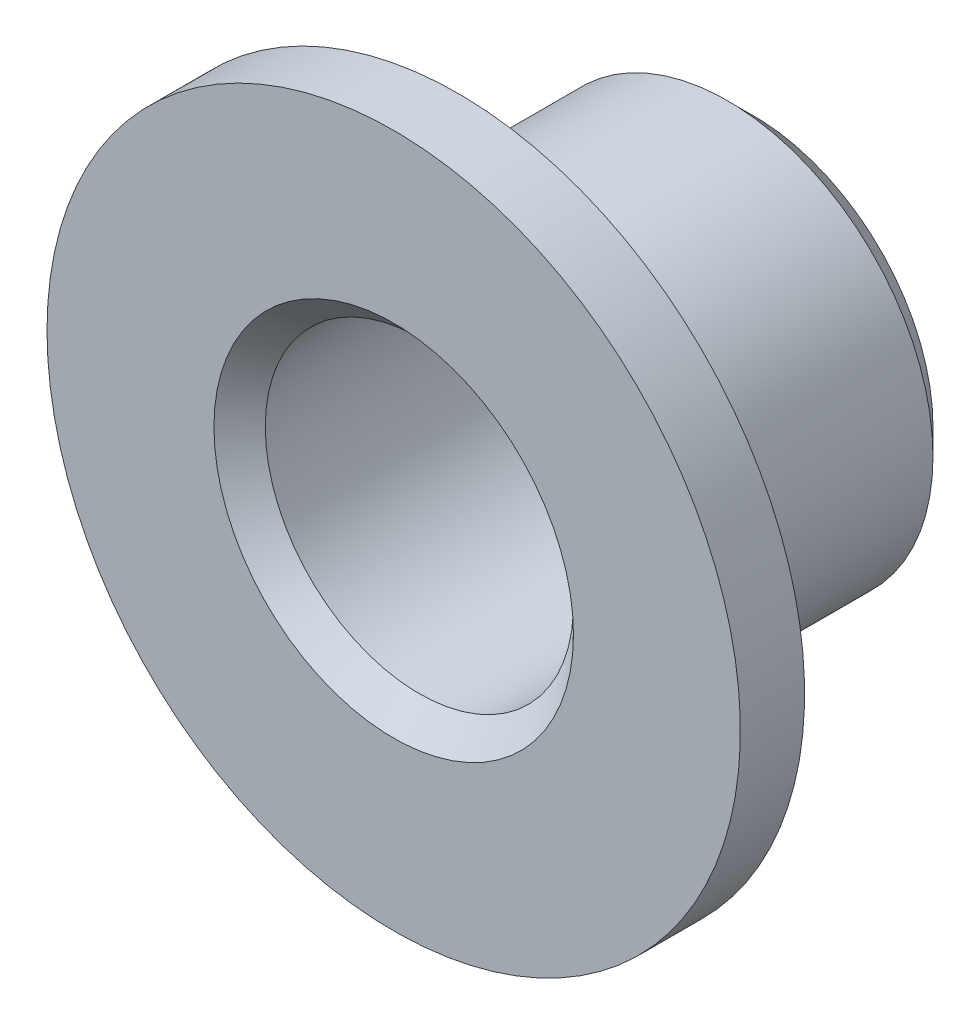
ISO-10303-21;
HEADER;
FILE_DESCRIPTION(('STEP AP214'),'2;1');
FILE_NAME('part.step','',(''),(''),'','','');
FILE_SCHEMA(('AUTOMOTIVE_DESIGN { 1 0 10303 214 1 1 1 1 }'));
ENDSEC;
DATA;
#1=APPLICATION_CONTEXT('core data for automotive mechanical design processes');
#2=APPLICATION_PROTOCOL_DEFINITION('international standard','automotive_design',2000,#1);
#3=PRODUCT_CONTEXT('',#1,'mechanical');
#4=PRODUCT('Part','Part','',(#3));
#5=PRODUCT_RELATED_PRODUCT_CATEGORY('part','',(#4));
#6=PRODUCT_DEFINITION_FORMATION('','',#4);
#7=PRODUCT_DEFINITION_CONTEXT('part definition',#1,'design');
#8=PRODUCT_DEFINITION('design','',#6,#7);
#9=PRODUCT_DEFINITION_SHAPE('','',#8);
#10=(LENGTH_UNIT() NAMED_UNIT(*) SI_UNIT(.MILLI.,.METRE.));
#11=(NAMED_UNIT(*) PLANE_ANGLE_UNIT() SI_UNIT($,.RADIAN.));
#12=(NAMED_UNIT(*) SI_UNIT($,.STERADIAN.) SOLID_ANGLE_UNIT());
#13=UNCERTAINTY_MEASURE_WITH_UNIT(LENGTH_MEASURE(1.E-05),#10,'distance_accuracy_value','');
#14=(GEOMETRIC_REPRESENTATION_CONTEXT(3) GLOBAL_UNCERTAINTY_ASSIGNED_CONTEXT((#13)) GLOBAL_UNIT_ASSIGNED_CONTEXT((#10,
#11,#12)) REPRESENTATION_CONTEXT('',''));
#15=CARTESIAN_POINT('',(0.,0.,0.));
#16=DIRECTION('',(0.,0.,1.));
#17=DIRECTION('',(1.,0.,0.));
#18=AXIS2_PLACEMENT_3D('',#15,#16,#17);
#19=CARTESIAN_POINT('',(0.,13.5,0.));
#20=DIRECTION('',(0.,0.,1.));
#21=DIRECTION('',(1.,0.,0.));
#22=AXIS2_PLACEMENT_3D('',#19,#20,#21);
#23=PLANE('',#22);
#24=CARTESIAN_POINT('',(0.,0.,0.));
#25=DIRECTION('',(0.,0.,-1.));
#26=DIRECTION('',(-1.,0.,0.));
#27=AXIS2_PLACEMENT_3D('',#24,#25,#26);
#28=CIRCLE('',#27,8.);
#29=CARTESIAN_POINT('',(-8.,0.,0.));
#30=VERTEX_POINT('',#29);
#31=EDGE_CURVE('E40',#30,#30,#28,.T.);
#32=ORIENTED_EDGE('',*,*,#31,.F.);
#33=EDGE_LOOP('',(#32));
#34=FACE_BOUND('',#33,.T.);
#35=CARTESIAN_POINT('',(0.,0.,0.));
#36=DIRECTION('',(0.,0.,-1.));
#37=DIRECTION('',(-1.,0.,0.));
#38=AXIS2_PLACEMENT_3D('',#35,#36,#37);
#39=CIRCLE('',#38,13.5);
#40=CARTESIAN_POINT('',(-13.5,0.,0.));
#41=VERTEX_POINT('',#40);
#42=EDGE_CURVE('E8',#41,#41,#39,.T.);
#43=ORIENTED_EDGE('',*,*,#42,.T.);
#44=EDGE_LOOP('',(#43));
#45=FACE_BOUND('',#44,.T.);
#46=ADVANCED_FACE('F12',(#34,#45),#23,.F.);
#47=CARTESIAN_POINT('',(0.,0.,-16.5));
#48=DIRECTION('',(0.,0.,-1.));
#49=DIRECTION('',(-1.,0.,0.));
#50=AXIS2_PLACEMENT_3D('',#47,#48,#49);
#51=CYLINDRICAL_SURFACE('',#50,13.5);
#52=ORIENTED_EDGE('',*,*,#42,.F.);
#53=EDGE_LOOP('',(#52));
#54=FACE_BOUND('',#53,.T.);
#55=CARTESIAN_POINT('',(0.,0.,2.5));
#56=DIRECTION('',(0.,0.,-1.));
#57=DIRECTION('',(-1.,0.,0.));
#58=AXIS2_PLACEMENT_3D('',#55,#56,#57);
#59=CIRCLE('',#58,13.5);
#60=CARTESIAN_POINT('',(-13.5,0.,2.5));
#61=VERTEX_POINT('',#60);
#62=EDGE_CURVE('E18',#61,#61,#59,.T.);
#63=ORIENTED_EDGE('',*,*,#62,.T.);
#64=EDGE_LOOP('',(#63));
#65=FACE_BOUND('',#64,.T.);
#66=ADVANCED_FACE('F47',(#54,#65),#51,.T.);
#67=CARTESIAN_POINT('',(0.,7.,2.5));
#68=DIRECTION('',(0.,0.,-1.));
#69=DIRECTION('',(-1.,0.,0.));
#70=AXIS2_PLACEMENT_3D('',#67,#68,#69);
#71=PLANE('',#70);
#72=ORIENTED_EDGE('',*,*,#62,.F.);
#73=EDGE_LOOP('',(#72));
#74=FACE_BOUND('',#73,.T.);
#75=CARTESIAN_POINT('',(0.,0.,2.5));
#76=DIRECTION('',(0.,0.,-1.));
#77=DIRECTION('',(-1.,0.,0.));
#78=AXIS2_PLACEMENT_3D('',#75,#76,#77);
#79=CIRCLE('',#78,7.);
#80=CARTESIAN_POINT('',(-7.,0.,2.5));
#81=VERTEX_POINT('',#80);
#82=EDGE_CURVE('E22',#81,#81,#79,.T.);
#83=ORIENTED_EDGE('',*,*,#82,.T.);
#84=EDGE_LOOP('',(#83));
#85=FACE_BOUND('',#84,.T.);
#86=ADVANCED_FACE('F53',(#74,#85),#71,.F.);
#87=CARTESIAN_POINT('',(0.,0.,2.5));
#88=DIRECTION('',(0.,0.,1.));
#89=DIRECTION('',(1.,0.,0.));
#90=AXIS2_PLACEMENT_3D('',#87,#88,#89);
#91=CONICAL_SURFACE('',#90,7.,0.785398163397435);
#92=CARTESIAN_POINT('',(0.,0.,1.5));
#93=DIRECTION('',(0.,0.,-1.));
#94=DIRECTION('',(-1.,0.,0.));
#95=AXIS2_PLACEMENT_3D('',#92,#93,#94);
#96=CIRCLE('',#95,6.);
#97=CARTESIAN_POINT('',(-6.,0.,1.5));
#98=VERTEX_POINT('',#97);
#99=EDGE_CURVE('E26',#98,#98,#96,.T.);
#100=ORIENTED_EDGE('',*,*,#99,.T.);
#101=EDGE_LOOP('',(#100));
#102=FACE_BOUND('',#101,.T.);
#103=ORIENTED_EDGE('',*,*,#82,.F.);
#104=EDGE_LOOP('',(#103));
#105=FACE_BOUND('',#104,.T.);
#106=ADVANCED_FACE('F59',(#102,#105),#91,.F.);
#107=CARTESIAN_POINT('',(0.,0.,-16.5));
#108=DIRECTION('',(0.,0.,-1.));
#109=DIRECTION('',(-1.,0.,0.));
#110=AXIS2_PLACEMENT_3D('',#107,#108,#109);
#111=CYLINDRICAL_SURFACE('',#110,6.);
#112=CARTESIAN_POINT('',(0.,0.,-11.5));
#113=DIRECTION('',(0.,0.,-1.));
#114=DIRECTION('',(-1.,0.,0.));
#115=AXIS2_PLACEMENT_3D('',#112,#113,#114);
#116=CIRCLE('',#115,6.);
#117=CARTESIAN_POINT('',(-6.,0.,-11.5));
#118=VERTEX_POINT('',#117);
#119=EDGE_CURVE('E31',#118,#118,#116,.T.);
#120=ORIENTED_EDGE('',*,*,#119,.T.);
#121=EDGE_LOOP('',(#120));
#122=FACE_BOUND('',#121,.T.);
#123=ORIENTED_EDGE('',*,*,#99,.F.);
#124=EDGE_LOOP('',(#123));
#125=FACE_BOUND('',#124,.T.);
#126=ADVANCED_FACE('F65',(#122,#125),#111,.F.);
#127=CARTESIAN_POINT('',(0.,7.,-11.5));
#128=DIRECTION('',(0.,0.,1.));
#129=DIRECTION('',(1.,0.,0.));
#130=AXIS2_PLACEMENT_3D('',#127,#128,#129);
#131=PLANE('',#130);
#132=ORIENTED_EDGE('',*,*,#119,.F.);
#133=EDGE_LOOP('',(#132));
#134=FACE_BOUND('',#133,.T.);
#135=CARTESIAN_POINT('',(0.,0.,-11.5));
#136=DIRECTION('',(0.,0.,-1.));
#137=DIRECTION('',(-1.,0.,0.));
#138=AXIS2_PLACEMENT_3D('',#135,#136,#137);
#139=CIRCLE('',#138,7.);
#140=CARTESIAN_POINT('',(-7.,0.,-11.5));
#141=VERTEX_POINT('',#140);
#142=EDGE_CURVE('E34',#141,#141,#139,.T.);
#143=ORIENTED_EDGE('',*,*,#142,.T.);
#144=EDGE_LOOP('',(#143));
#145=FACE_BOUND('',#144,.T.);
#146=ADVANCED_FACE('F69',(#134,#145),#131,.F.);
#147=CARTESIAN_POINT('',(0.,0.,-10.5));
#148=DIRECTION('',(0.,0.,1.));
#149=DIRECTION('',(1.,0.,0.));
#150=AXIS2_PLACEMENT_3D('',#147,#148,#149);
#151=CONICAL_SURFACE('',#150,8.,0.785398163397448);
#152=ORIENTED_EDGE('',*,*,#142,.F.);
#153=EDGE_LOOP('',(#152));
#154=FACE_BOUND('',#153,.T.);
#155=CARTESIAN_POINT('',(0.,0.,-10.5));
#156=DIRECTION('',(0.,0.,-1.));
#157=DIRECTION('',(-1.,0.,0.));
#158=AXIS2_PLACEMENT_3D('',#155,#156,#157);
#159=CIRCLE('',#158,8.);
#160=CARTESIAN_POINT('',(-8.,0.,-10.5));
#161=VERTEX_POINT('',#160);
#162=EDGE_CURVE('E37',#161,#161,#159,.T.);
#163=ORIENTED_EDGE('',*,*,#162,.T.);
#164=EDGE_LOOP('',(#163));
#165=FACE_BOUND('',#164,.T.);
#166=ADVANCED_FACE('F73',(#154,#165),#151,.T.);
#167=CARTESIAN_POINT('',(0.,0.,-16.5));
#168=DIRECTION('',(0.,0.,-1.));
#169=DIRECTION('',(-1.,0.,0.));
#170=AXIS2_PLACEMENT_3D('',#167,#168,#169);
#171=CYLINDRICAL_SURFACE('',#170,8.);
#172=ORIENTED_EDGE('',*,*,#162,.F.);
#173=EDGE_LOOP('',(#172));
#174=FACE_BOUND('',#173,.T.);
#175=ORIENTED_EDGE('',*,*,#31,.T.);
#176=EDGE_LOOP('',(#175));
#177=FACE_BOUND('',#176,.T.);
#178=ADVANCED_FACE('F44',(#174,#177),#171,.T.);
#179=CLOSED_SHELL('',(#46,#66,#86,#106,#126,#146,#166,#178));
#180=MANIFOLD_SOLID_BREP('B1',#179);
#181=ADVANCED_BREP_SHAPE_REPRESENTATION('',(#18,#180),#14);
#182=SHAPE_DEFINITION_REPRESENTATION(#9,#181);
ENDSEC;
END-ISO-10303-21;
